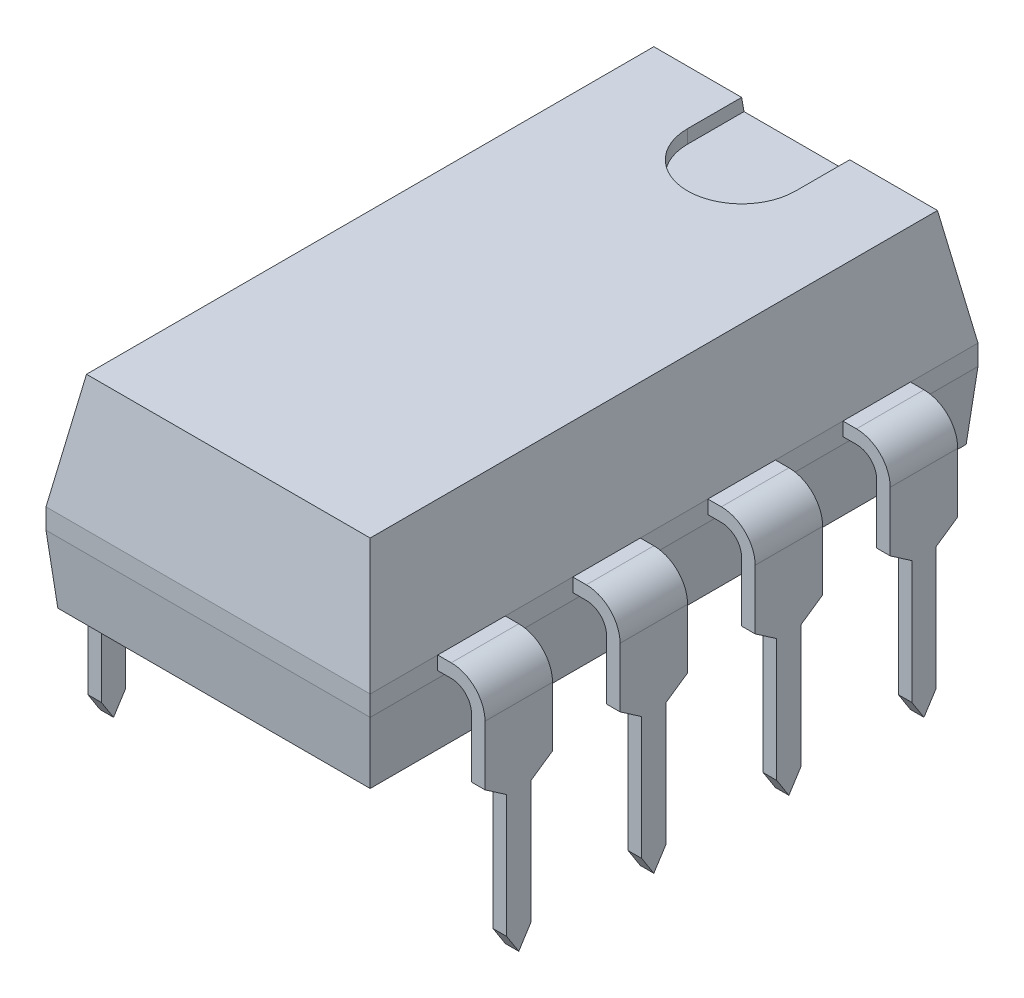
from build123d import *
from OCP.BRepFilletAPI import BRepFilletAPI_MakeChamfer

# Parameters (mm, degrees)
SKETCH1_W                = 11.43
SKETCH1_H                = 6.096
BASE_EXTRUDE_DEPTH       = 3.81
CHAMFER1_SIZE            = 2.159
CHAMFER1_SIZE2           = 0.380689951
CHAMFER2_SIZE            = 1.27
CHAMFER2_SIZE2           = 0.111110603
CUT_EXTRUDE1_DEPTH       = 0.254
BOSS_EXTRUDE_THIN1_DEPTH = 0.635
CUT_EXTRUDE2_DEPTH       = 0.254
CUT_EXTRUDE3_DEPTH       = 0.254
LPATTERN1_COUNT          = 4
LPATTERN1_PITCH          = 2.54
MIRROR1_COPY_1_DEPTH     = 0.635
MIRROR1_COPY_2_DEPTH     = 0.635
MIRROR1_COPY_3_DEPTH     = 0.635
MIRROR1_COPY_4_DEPTH     = 0.254
MIRROR1_COPY_5_DEPTH     = 0.254
MIRROR1_COPY_6_DEPTH     = 0.254
MIRROR1_COPY_7_DEPTH     = 0.254
MIRROR1_COPY_8_DEPTH     = 0.254
MIRROR1_COPY_9_DEPTH     = 0.254


with BuildPart() as part:
    # Sketch1 → Base-Extrude (new body)
    with BuildSketch(Plane(origin=(0, 0.381, 0), x_dir=(0, 0, -1), z_dir=(0, 1, 0))):
        with Locations((-3.81, -3.81)):
            Rectangle(SKETCH1_W, SKETCH1_H)
    extrude(amount=BASE_EXTRUDE_DEPTH)

    # Chamfer1: one chamfer whose edges measure the first distance from different faces: ONE call of the kernel's chamfer builder (chamfer() names one face for all edges)
    chamfer1_edges_1 = [part.edges().sort_by_distance(p)[0] for p in [
        (3.81, 4.191, 9.525),
    ]]
    chamfer1_side_1 = [part.faces().sort_by_distance(p)[0] for p in [
        (3.81, 2.286, 9.525),
    ]]
    chamfer1_edges_2 = [part.edges().sort_by_distance(p)[0] for p in [
        (6.858, 4.191, 3.81),
    ]]
    chamfer1_side_2 = [part.faces().sort_by_distance(p)[0] for p in [
        (6.858, 2.286, 3.81),
    ]]
    chamfer1_edges_3 = [part.edges().sort_by_distance(p)[0] for p in [
        (3.81, 4.191, -1.905),
    ]]
    chamfer1_side_3 = [part.faces().sort_by_distance(p)[0] for p in [
        (3.81, 2.286, -1.905),
    ]]
    chamfer1_edges_4 = [part.edges().sort_by_distance(p)[0] for p in [
        (0.762, 4.191, 3.81),
    ]]
    chamfer1_side_4 = [part.faces().sort_by_distance(p)[0] for p in [
        (0.762, 2.286, 3.81),
    ]]
    chamfer1 = BRepFilletAPI_MakeChamfer(part.part.solid().wrapped)
    for e in chamfer1_edges_1:
        chamfer1.Add(CHAMFER1_SIZE, CHAMFER1_SIZE2, e.wrapped, chamfer1_side_1[0].wrapped)  # the first distance lies on this face
    for e in chamfer1_edges_2:
        chamfer1.Add(CHAMFER1_SIZE, CHAMFER1_SIZE2, e.wrapped, chamfer1_side_2[0].wrapped)  # the first distance lies on this face
    for e in chamfer1_edges_3:
        chamfer1.Add(CHAMFER1_SIZE, CHAMFER1_SIZE2, e.wrapped, chamfer1_side_3[0].wrapped)  # the first distance lies on this face
    for e in chamfer1_edges_4:
        chamfer1.Add(CHAMFER1_SIZE, CHAMFER1_SIZE2, e.wrapped, chamfer1_side_4[0].wrapped)  # the first distance lies on this face
    add(Compound.cast(chamfer1.Shape()), mode=Mode.REPLACE)

    # Chamfer2: one chamfer whose edges measure the first distance from different faces: ONE call of the kernel's chamfer builder (chamfer() names one face for all edges)
    chamfer2_edges_1 = [part.edges().sort_by_distance(p)[0] for p in [
        (6.858, 0.381, 3.81),
    ]]
    chamfer2_side_1 = [part.faces().sort_by_distance(p)[0] for p in [
        (6.858, 1.2065, 3.81),
    ]]
    chamfer2_edges_2 = [part.edges().sort_by_distance(p)[0] for p in [
        (3.81, 0.381, 9.525),
    ]]
    chamfer2_side_2 = [part.faces().sort_by_distance(p)[0] for p in [
        (3.81, 1.2065, 9.525),
    ]]
    chamfer2_edges_3 = [part.edges().sort_by_distance(p)[0] for p in [
        (0.762, 0.381, 3.81),
    ]]
    chamfer2_side_3 = [part.faces().sort_by_distance(p)[0] for p in [
        (0.762, 1.2065, 3.81),
    ]]
    chamfer2_edges_4 = [part.edges().sort_by_distance(p)[0] for p in [
        (3.81, 0.381, -1.905),
    ]]
    chamfer2_side_4 = [part.faces().sort_by_distance(p)[0] for p in [
        (3.81, 1.2065, -1.905),
    ]]
    chamfer2 = BRepFilletAPI_MakeChamfer(part.part.solid().wrapped)
    for e in chamfer2_edges_1:
        chamfer2.Add(CHAMFER2_SIZE, CHAMFER2_SIZE2, e.wrapped, chamfer2_side_1[0].wrapped)  # the first distance lies on this face
    for e in chamfer2_edges_2:
        chamfer2.Add(CHAMFER2_SIZE, CHAMFER2_SIZE2, e.wrapped, chamfer2_side_2[0].wrapped)  # the first distance lies on this face
    for e in chamfer2_edges_3:
        chamfer2.Add(CHAMFER2_SIZE, CHAMFER2_SIZE2, e.wrapped, chamfer2_side_3[0].wrapped)  # the first distance lies on this face
    for e in chamfer2_edges_4:
        chamfer2.Add(CHAMFER2_SIZE, CHAMFER2_SIZE2, e.wrapped, chamfer2_side_4[0].wrapped)  # the first distance lies on this face
    add(Compound.cast(chamfer2.Shape()), mode=Mode.REPLACE)

    # Sketch2 → Cut-Extrude1 (cut)
    with BuildSketch(Plane(origin=(0, 4.191, 0), x_dir=(-1, 0, 0), z_dir=(0, 1, 0))):
        with BuildLine():
            Line((-2.794, -2.791910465), (-4.826, -2.791910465))
            Line((-4.826, -2.791910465), (-4.826, -0.508310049))
            ThreePointArc((-4.826, -0.508310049), (-3.81, 0.507689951), (-2.794, -0.508310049))
            Line((-2.794, -0.508310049), (-2.794, -2.791910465))
        make_face()
    extrude(amount=-CUT_EXTRUDE1_DEPTH, mode=Mode.SUBTRACT)

    # Sketch3 → Boss-Extrude-Thin1 (add, symmetric)
    with BuildSketch(Plane(origin=(9.017, 0, 0), x_dir=(-1, 0, 0), z_dir=(0, 0, -1))):
        with BuildLine():
            Line((6.913298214, 1.778), (8.509, 1.778))
            ThreePointArc((8.509, 1.778), (8.778407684, 1.666407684), (8.89, 1.397))
            Line((8.89, 1.397), (8.89, -2.667))
            Line((8.89, -2.667), (9.144, -2.667))
            Line((9.144, -2.667), (9.144, 1.397))
            ThreePointArc((9.144, 1.397), (8.958012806, 1.846012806), (8.509, 2.032))
            Line((8.509, 2.032), (6.913298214, 2.032))
            Line((6.913298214, 2.032), (6.913298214, 1.778))
        make_face()
    boss_extrude_thin1 = extrude(amount=BOSS_EXTRUDE_THIN1_DEPTH, both=True)

    # Sketch4 → Cut-Extrude2 (cut)
    with BuildSketch(Plane(origin=(0.127, 0, 0), x_dir=(0, 0, -1), z_dir=(1, 0, 0))):
        Polygon((-0.635, 0.2794), (-0.2286, 0), (-0.2286, -2.309519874), (0, -2.667), (-0.635, -2.667), align=None)
    cut_extrude2 = extrude(amount=-CUT_EXTRUDE2_DEPTH, mode=Mode.SUBTRACT)

    # Sketch5 → Cut-Extrude3 (cut)
    with BuildSketch(Plane(origin=(0.127, 0, 0), x_dir=(0, 0, -1), z_dir=(1, 0, 0))):
        Polygon((0.635, -2.667), (0, -2.667), (0.2286, -2.309519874), (0.2286, 0), (0.635, 0.2794), align=None)
    cut_extrude3 = extrude(amount=-CUT_EXTRUDE3_DEPTH, mode=Mode.SUBTRACT)

    # LPattern1: Boss-Extrude-Thin1, Cut-Extrude2, Cut-Extrude3 ×4
    with Locations(*[(0, 0, i * LPATTERN1_PITCH) for i in range(1, LPATTERN1_COUNT)]):
        add(boss_extrude_thin1)
        add(cut_extrude2, mode=Mode.SUBTRACT)
        add(cut_extrude3, mode=Mode.SUBTRACT)

    # Mirror1: Boss-Extrude-Thin1, Cut-Extrude2, Cut-Extrude3 across plane
    add(boss_extrude_thin1.mirror(Plane.ZY.offset(-3.81)))
    add(cut_extrude2.mirror(Plane.ZY.offset(-3.81)), mode=Mode.SUBTRACT)
    add(cut_extrude3.mirror(Plane.ZY.offset(-3.81)), mode=Mode.SUBTRACT)

    # Mirror1 copy 1 sketch → Mirror1 copy 1 (add, symmetric)
    with BuildSketch(Plane(origin=(-1.397, 0, 2.54), x_dir=(1, 0, 0), z_dir=(0, 0, -1))):
        with BuildLine():
            Line((6.913298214, -1.778), (8.509, -1.778))
            ThreePointArc((8.509, -1.778), (8.778407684, -1.666407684), (8.89, -1.397))
            Line((8.89, -1.397), (8.89, 2.667))
            Line((8.89, 2.667), (9.144, 2.667))
            Line((9.144, 2.667), (9.144, -1.397))
            ThreePointArc((9.144, -1.397), (8.958012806, -1.846012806), (8.509, -2.032))
            Line((8.509, -2.032), (6.913298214, -2.032))
            Line((6.913298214, -2.032), (6.913298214, -1.778))
        make_face()
    extrude(amount=MIRROR1_COPY_1_DEPTH, both=True)

    # Mirror1 copy 2 sketch → Mirror1 copy 2 (add, symmetric)
    with BuildSketch(Plane(origin=(-1.397, 0, 5.08), x_dir=(1, 0, 0), z_dir=(0, 0, -1))):
        with BuildLine():
            Line((6.913298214, -1.778), (8.509, -1.778))
            ThreePointArc((8.509, -1.778), (8.778407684, -1.666407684), (8.89, -1.397))
            Line((8.89, -1.397), (8.89, 2.667))
            Line((8.89, 2.667), (9.144, 2.667))
            Line((9.144, 2.667), (9.144, -1.397))
            ThreePointArc((9.144, -1.397), (8.958012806, -1.846012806), (8.509, -2.032))
            Line((8.509, -2.032), (6.913298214, -2.032))
            Line((6.913298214, -2.032), (6.913298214, -1.778))
        make_face()
    extrude(amount=MIRROR1_COPY_2_DEPTH, both=True)

    # Mirror1 copy 3 sketch → Mirror1 copy 3 (add, symmetric)
    with BuildSketch(Plane(origin=(-1.397, 0, 7.62), x_dir=(1, 0, 0), z_dir=(0, 0, -1))):
        with BuildLine():
            Line((6.913298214, -1.778), (8.509, -1.778))
            ThreePointArc((8.509, -1.778), (8.778407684, -1.666407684), (8.89, -1.397))
            Line((8.89, -1.397), (8.89, 2.667))
            Line((8.89, 2.667), (9.144, 2.667))
            Line((9.144, 2.667), (9.144, -1.397))
            ThreePointArc((9.144, -1.397), (8.958012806, -1.846012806), (8.509, -2.032))
            Line((8.509, -2.032), (6.913298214, -2.032))
            Line((6.913298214, -2.032), (6.913298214, -1.778))
        make_face()
    extrude(amount=MIRROR1_COPY_3_DEPTH, both=True)

    # Mirror1 copy 4 sketch → Mirror1 copy 4 (cut)
    with BuildSketch(Plane(origin=(7.493, 0, 2.54), x_dir=(0, 0, -1), z_dir=(-1, 0, 0))):
        Polygon((-0.635, -0.2794), (-0.2286, 0), (-0.2286, 2.309519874), (0, 2.667), (-0.635, 2.667), align=None)
    extrude(amount=-MIRROR1_COPY_4_DEPTH, mode=Mode.SUBTRACT)

    # Mirror1 copy 5 sketch → Mirror1 copy 5 (cut)
    with BuildSketch(Plane(origin=(7.493, 0, 5.08), x_dir=(0, 0, -1), z_dir=(-1, 0, 0))):
        Polygon((-0.635, -0.2794), (-0.2286, 0), (-0.2286, 2.309519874), (0, 2.667), (-0.635, 2.667), align=None)
    extrude(amount=-MIRROR1_COPY_5_DEPTH, mode=Mode.SUBTRACT)

    # Mirror1 copy 6 sketch → Mirror1 copy 6 (cut)
    with BuildSketch(Plane(origin=(7.493, 0, 7.62), x_dir=(0, 0, -1), z_dir=(-1, 0, 0))):
        Polygon((-0.635, -0.2794), (-0.2286, 0), (-0.2286, 2.309519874), (0, 2.667), (-0.635, 2.667), align=None)
    extrude(amount=-MIRROR1_COPY_6_DEPTH, mode=Mode.SUBTRACT)

    # Mirror1 copy 7 sketch → Mirror1 copy 7 (cut)
    with BuildSketch(Plane(origin=(7.493, 0, 2.54), x_dir=(0, 0, -1), z_dir=(-1, 0, 0))):
        Polygon((0.635, 2.667), (0, 2.667), (0.2286, 2.309519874), (0.2286, 0), (0.635, -0.2794), align=None)
    extrude(amount=-MIRROR1_COPY_7_DEPTH, mode=Mode.SUBTRACT)

    # Mirror1 copy 8 sketch → Mirror1 copy 8 (cut)
    with BuildSketch(Plane(origin=(7.493, 0, 5.08), x_dir=(0, 0, -1), z_dir=(-1, 0, 0))):
        Polygon((0.635, 2.667), (0, 2.667), (0.2286, 2.309519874), (0.2286, 0), (0.635, -0.2794), align=None)
    extrude(amount=-MIRROR1_COPY_8_DEPTH, mode=Mode.SUBTRACT)

    # Mirror1 copy 9 sketch → Mirror1 copy 9 (cut)
    with BuildSketch(Plane(origin=(7.493, 0, 7.62), x_dir=(0, 0, -1), z_dir=(-1, 0, 0))):
        Polygon((0.635, 2.667), (0, 2.667), (0.2286, 2.309519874), (0.2286, 0), (0.635, -0.2794), align=None)
    extrude(amount=-MIRROR1_COPY_9_DEPTH, mode=Mode.SUBTRACT)


solid = part.part
